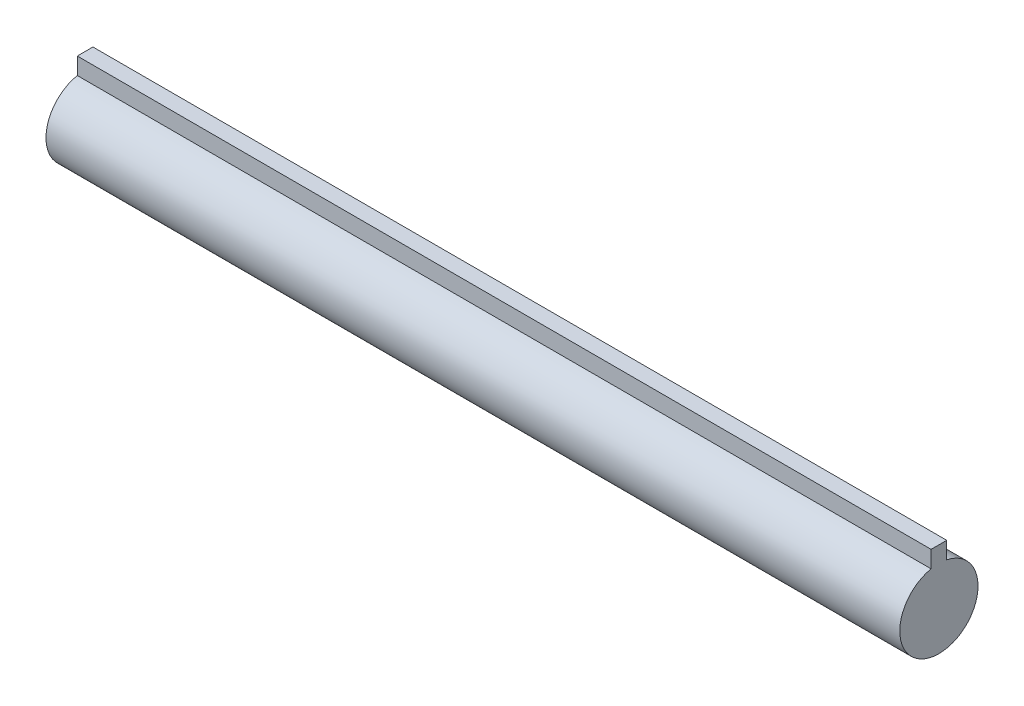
ISO-10303-21;
HEADER;
FILE_DESCRIPTION(('STEP AP214'),'2;1');
FILE_NAME('part.step','',(''),(''),'','','');
FILE_SCHEMA(('AUTOMOTIVE_DESIGN { 1 0 10303 214 1 1 1 1 }'));
ENDSEC;
DATA;
#1=APPLICATION_CONTEXT('core data for automotive mechanical design processes');
#2=APPLICATION_PROTOCOL_DEFINITION('international standard','automotive_design',2000,#1);
#3=PRODUCT_CONTEXT('',#1,'mechanical');
#4=PRODUCT('Part','Part','',(#3));
#5=PRODUCT_RELATED_PRODUCT_CATEGORY('part','',(#4));
#6=PRODUCT_DEFINITION_FORMATION('','',#4);
#7=PRODUCT_DEFINITION_CONTEXT('part definition',#1,'design');
#8=PRODUCT_DEFINITION('design','',#6,#7);
#9=PRODUCT_DEFINITION_SHAPE('','',#8);
#10=(LENGTH_UNIT() NAMED_UNIT(*) SI_UNIT(.MILLI.,.METRE.));
#11=(NAMED_UNIT(*) PLANE_ANGLE_UNIT() SI_UNIT($,.RADIAN.));
#12=(NAMED_UNIT(*) SI_UNIT($,.STERADIAN.) SOLID_ANGLE_UNIT());
#13=UNCERTAINTY_MEASURE_WITH_UNIT(LENGTH_MEASURE(1.E-05),#10,'distance_accuracy_value','');
#14=(GEOMETRIC_REPRESENTATION_CONTEXT(3) GLOBAL_UNCERTAINTY_ASSIGNED_CONTEXT((#13)) GLOBAL_UNIT_ASSIGNED_CONTEXT((#10,
#11,#12)) REPRESENTATION_CONTEXT('',''));
#15=CARTESIAN_POINT('',(0.,0.,0.));
#16=DIRECTION('',(0.,0.,1.));
#17=DIRECTION('',(1.,0.,0.));
#18=AXIS2_PLACEMENT_3D('',#15,#16,#17);
#19=CARTESIAN_POINT('',(12881.0521597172,5722.16070466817,-21.5031202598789));
#20=DIRECTION('',(0.000311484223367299,0.999999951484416,2.9572027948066E-06));
#21=DIRECTION('',(-0.999999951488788,0.000311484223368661,0.));
#22=AXIS2_PLACEMENT_3D('',#19,#20,#21);
#23=PLANE('',#22);
#24=DIRECTION('',(-5.67539324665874E-05,1.76779649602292E-08,0.999999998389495));
#25=VECTOR('',#24,1.);
#26=CARTESIAN_POINT('',(12881.0521994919,5722.16070465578,-22.2039485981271));
#27=LINE('',#26,#25);
#28=CARTESIAN_POINT('',(12881.0521597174,5722.16070466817,-21.5031243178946));
#29=VERTEX_POINT('',#28);
#30=CARTESIAN_POINT('',(12881.0523038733,5722.16070837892,-24.0431202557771));
#31=VERTEX_POINT('',#30);
#32=EDGE_CURVE('E63',#29,#31,#27,.F.);
#33=ORIENTED_EDGE('',*,*,#32,.F.);
#34=DIRECTION('',(-0.999999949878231,0.000311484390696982,-5.67539352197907E-05));
#35=VECTOR('',#34,1.);
#36=CARTESIAN_POINT('',(13019.7107527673,5722.11751467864,-21.4952508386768));
#37=LINE('',#36,#35);
#38=CARTESIAN_POINT('',(13019.7107527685,5722.11751843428,-21.4952508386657));
#39=VERTEX_POINT('',#38);
#40=EDGE_CURVE('E61',#39,#29,#37,.T.);
#41=ORIENTED_EDGE('',*,*,#40,.F.);
#42=DIRECTION('',(-5.67539324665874E-05,1.76779649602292E-08,0.999999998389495));
#43=VECTOR('',#42,1.);
#44=CARTESIAN_POINT('',(13019.7107925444,5722.11752217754,-22.1960791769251));
#45=LINE('',#44,#43);
#46=CARTESIAN_POINT('',(13019.7108969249,5722.11752214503,-24.0352548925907));
#47=VERTEX_POINT('',#46);
#48=EDGE_CURVE('E18',#47,#39,#45,.T.);
#49=ORIENTED_EDGE('',*,*,#48,.F.);
#50=DIRECTION('',(0.999999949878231,-0.000311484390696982,5.67539352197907E-05));
#51=VECTOR('',#50,1.);
#52=CARTESIAN_POINT('',(12881.0523038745,5722.16071213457,-24.0431202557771));
#53=LINE('',#52,#51);
#54=EDGE_CURVE('E75',#31,#47,#53,.T.);
#55=ORIENTED_EDGE('',*,*,#54,.F.);
#56=EDGE_LOOP('',(#33,#41,#49,#55));
#57=FACE_BOUND('',#56,.T.);
#58=ADVANCED_FACE('F14',(#57),#23,.T.);
#59=CARTESIAN_POINT('',(12881.0523038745,5722.16071213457,-24.0431202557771));
#60=DIRECTION('',(5.67548535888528E-05,2.93952469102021E-06,-0.999999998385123));
#61=DIRECTION('',(-0.999999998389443,0.,-5.67548535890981E-05));
#62=AXIS2_PLACEMENT_3D('',#59,#60,#61);
#63=PLANE('',#62);
#64=ORIENTED_EDGE('',*,*,#54,.T.);
#65=DIRECTION('',(0.000311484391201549,0.999999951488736,0.));
#66=VECTOR('',#65,1.);
#67=CARTESIAN_POINT('',(13019.7090770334,5716.27488049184,-24.0352589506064));
#68=LINE('',#67,#66);
#69=CARTESIAN_POINT('',(13019.7100420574,5719.37302622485,-24.0352589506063));
#70=VERTEX_POINT('',#69);
#71=EDGE_CURVE('E58',#70,#47,#68,.T.);
#72=ORIENTED_EDGE('',*,*,#71,.F.);
#73=DIRECTION('',(0.999999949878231,-0.000311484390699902,5.67539352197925E-05));
#74=VECTOR('',#73,1.);
#75=CARTESIAN_POINT('',(12950.3807455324,5719.39462121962,-24.0391936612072));
#76=LINE('',#75,#74);
#77=CARTESIAN_POINT('',(12881.0514490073,5719.41621704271,-24.0431243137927));
#78=VERTEX_POINT('',#77);
#79=EDGE_CURVE('E72',#78,#70,#76,.T.);
#80=ORIENTED_EDGE('',*,*,#79,.F.);
#81=DIRECTION('',(-0.000311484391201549,-0.999999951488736,0.));
#82=VECTOR('',#81,1.);
#83=CARTESIAN_POINT('',(12881.0504839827,5716.31807048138,-24.0431202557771));
#84=LINE('',#83,#82);
#85=EDGE_CURVE('E79',#31,#78,#84,.T.);
#86=ORIENTED_EDGE('',*,*,#85,.F.);
#87=EDGE_LOOP('',(#64,#72,#80,#86));
#88=FACE_BOUND('',#87,.T.);
#89=ADVANCED_FACE('F88',(#88),#63,.T.);
#90=CARTESIAN_POINT('',(13019.7089726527,5716.27488052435,-22.1960791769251));
#91=DIRECTION('',(0.999999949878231,-0.000311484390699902,5.67539352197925E-05));
#92=DIRECTION('',(0.000311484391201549,0.999999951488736,0.));
#93=AXIS2_PLACEMENT_3D('',#90,#91,#92);
#94=PLANE('',#93);
#95=ORIENTED_EDGE('',*,*,#48,.T.);
#96=DIRECTION('',(0.00031148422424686,0.999999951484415,2.9572027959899E-06));
#97=VECTOR('',#96,1.);
#98=CARTESIAN_POINT('',(13019.7098979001,5719.37301875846,-21.4952589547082));
#99=LINE('',#98,#97);
#100=CARTESIAN_POINT('',(13019.7098979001,5719.37301875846,-21.4952589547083));
#101=VERTEX_POINT('',#100);
#102=EDGE_CURVE('E56',#101,#39,#99,.T.);
#103=ORIENTED_EDGE('',*,*,#102,.F.);
#104=CARTESIAN_POINT('',(13019.7080320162,5713.15131884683,-22.7652773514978));
#105=DIRECTION('',(0.999999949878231,-0.000311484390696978,5.675393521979E-05));
#106=DIRECTION('',(0.000311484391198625,0.999999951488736,0.));
#107=AXIS2_PLACEMENT_3D('',#104,#105,#106);
#108=CIRCLE('',#107,6.35000000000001);
#109=EDGE_CURVE('E77',#70,#101,#108,.F.);
#110=ORIENTED_EDGE('',*,*,#109,.F.);
#111=ORIENTED_EDGE('',*,*,#71,.T.);
#112=EDGE_LOOP('',(#95,#103,#110,#111));
#113=FACE_BOUND('',#112,.T.);
#114=ADVANCED_FACE('F53',(#113),#94,.T.);
#115=CARTESIAN_POINT('',(12881.0509729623,5718.35070485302,-21.5031315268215));
#116=DIRECTION('',(-5.67548535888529E-05,-2.93952469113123E-06,0.999999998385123));
#117=DIRECTION('',(0.999999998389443,0.,5.67548535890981E-05));
#118=AXIS2_PLACEMENT_3D('',#115,#116,#117);
#119=PLANE('',#118);
#120=ORIENTED_EDGE('',*,*,#40,.T.);
#121=DIRECTION('',(-0.000311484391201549,-0.999999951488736,0.));
#122=VECTOR('',#121,1.);
#123=CARTESIAN_POINT('',(12881.0503398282,5716.31807052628,-21.5031283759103));
#124=LINE('',#123,#122);
#125=CARTESIAN_POINT('',(12881.0513048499,5719.41620874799,-21.5031283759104));
#126=VERTEX_POINT('',#125);
#127=EDGE_CURVE('E33',#126,#29,#124,.F.);
#128=ORIENTED_EDGE('',*,*,#127,.F.);
#129=DIRECTION('',(0.999999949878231,-0.000311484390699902,5.67539352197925E-05));
#130=VECTOR('',#129,1.);
#131=CARTESIAN_POINT('',(12950.380601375,5719.39461375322,-21.4991936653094));
#132=LINE('',#131,#130);
#133=EDGE_CURVE('E24',#101,#126,#132,.F.);
#134=ORIENTED_EDGE('',*,*,#133,.F.);
#135=ORIENTED_EDGE('',*,*,#102,.T.);
#136=EDGE_LOOP('',(#120,#128,#134,#135));
#137=FACE_BOUND('',#136,.T.);
#138=ADVANCED_FACE('F65',(#137),#119,.T.);
#139=CARTESIAN_POINT('',(12881.0503796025,5716.31807051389,-22.2039485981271));
#140=DIRECTION('',(-0.999999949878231,0.000311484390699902,-5.67539352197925E-05));
#141=DIRECTION('',(-0.000311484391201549,-0.999999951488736,0.));
#142=AXIS2_PLACEMENT_3D('',#139,#140,#141);
#143=PLANE('',#142);
#144=ORIENTED_EDGE('',*,*,#85,.T.);
#145=CARTESIAN_POINT('',(12881.049438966,5713.19450883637,-22.7731467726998));
#146=DIRECTION('',(0.999999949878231,-0.000311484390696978,5.675393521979E-05));
#147=DIRECTION('',(0.000311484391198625,0.999999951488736,0.));
#148=AXIS2_PLACEMENT_3D('',#145,#146,#147);
#149=CIRCLE('',#148,6.35000000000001);
#150=EDGE_CURVE('E9',#126,#78,#149,.T.);
#151=ORIENTED_EDGE('',*,*,#150,.F.);
#152=ORIENTED_EDGE('',*,*,#127,.T.);
#153=ORIENTED_EDGE('',*,*,#32,.T.);
#154=EDGE_LOOP('',(#144,#151,#152,#153));
#155=FACE_BOUND('',#154,.T.);
#156=ADVANCED_FACE('F83',(#155),#143,.T.);
#157=CARTESIAN_POINT('',(12881.049438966,5713.19450883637,-22.7731467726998));
#158=DIRECTION('',(0.999999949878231,-0.000311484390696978,5.675393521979E-05));
#159=DIRECTION('',(0.000311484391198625,0.999999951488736,0.));
#160=AXIS2_PLACEMENT_3D('',#157,#158,#159);
#161=CYLINDRICAL_SURFACE('',#160,6.35000000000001);
#162=ORIENTED_EDGE('',*,*,#133,.T.);
#163=ORIENTED_EDGE('',*,*,#150,.T.);
#164=ORIENTED_EDGE('',*,*,#79,.T.);
#165=ORIENTED_EDGE('',*,*,#109,.T.);
#166=EDGE_LOOP('',(#162,#163,#164,#165));
#167=FACE_BOUND('',#166,.T.);
#168=ADVANCED_FACE('F16',(#167),#161,.T.);
#169=CLOSED_SHELL('',(#58,#89,#114,#138,#156,#168));
#170=MANIFOLD_SOLID_BREP('B1',#169);
#171=ADVANCED_BREP_SHAPE_REPRESENTATION('',(#18,#170),#14);
#172=SHAPE_DEFINITION_REPRESENTATION(#9,#171);
ENDSEC;
END-ISO-10303-21;
